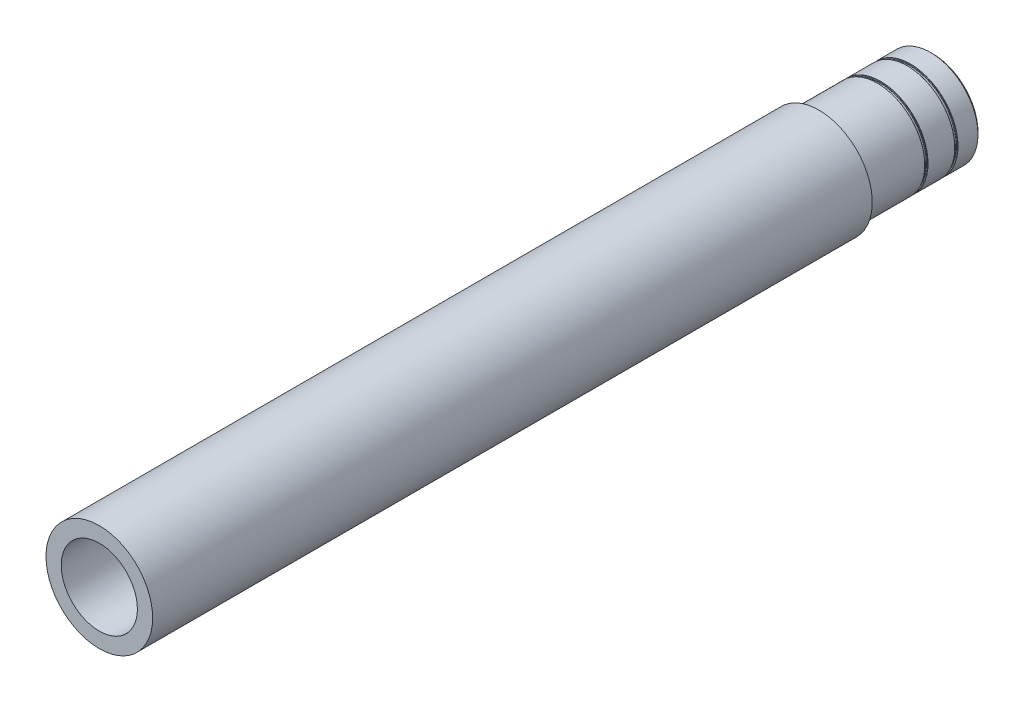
from build123d import *

# Parameters (mm, degrees)
SKETCH1_R           = 44.45
SKETCH1_R_2         = 31.75
BOSS_EXTRUDE1_DEPTH = 700
SKETCH2_OUTSIDE_W   = 233.14
SKETCH2_OUTSIDE_H   = 233.14
SKETCH2_OUTSIDE_R   = 39.6
CUT_EXTRUDE1_DEPTH  = 100
FILLET2_R           = 0.1778
SKETCH7_R           = 44.45
CUT_EXTRUDE3_DEPTH  = 5
CHAMFER1_SIZE       = 2


with BuildPart() as part:
    # Sketch1 → Boss-Extrude1 (new body)
    with BuildSketch(Plane.XY):
        Circle(SKETCH1_R)
        Circle(SKETCH1_R_2, mode=Mode.SUBTRACT)
    extrude(amount=BOSS_EXTRUDE1_DEPTH)

    # Sketch2 outside → Cut-Extrude1 (cut)
    with BuildSketch(Plane(origin=(0, 0, 0), x_dir=(-1, 0, 0), z_dir=(0, 0, -1))):
        Rectangle(SKETCH2_OUTSIDE_W, SKETCH2_OUTSIDE_H)
        Circle(SKETCH2_OUTSIDE_R, mode=Mode.SUBTRACT)
    extrude(amount=-CUT_EXTRUDE1_DEPTH, mode=Mode.SUBTRACT)

    # Sketch3 → Cut-Revolve1 (revolve, cut)
    with BuildSketch(Plane(origin=(0, 0, 0), x_dir=(0, 0, -1), z_dir=(1, 0, 0)), mode=Mode.PRIVATE) as cut_revolve1_sk:
        with BuildLine():
            Line((-51.1811, 40.8446), (-51.1811, 38.6094))
            ThreePointArc((-51.1811, 38.6094), (-51.106705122, 38.429794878), (-50.9271, 38.3554))
            Line((-50.9271, 38.3554), (-49.0729, 38.3554))
            ThreePointArc((-49.0729, 38.3554), (-48.893294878, 38.429794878), (-48.8189, 38.6094))
            Line((-48.8189, 38.6094), (-48.8189, 40.8446))
            Line((-48.8189, 40.8446), (-51.1811, 40.8446))
        make_face()
        with BuildLine():
            Line((-26.1811, 40.8446), (-26.1811, 38.6094))
            ThreePointArc((-26.1811, 38.6094), (-26.106705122, 38.429794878), (-25.9271, 38.3554))
            Line((-25.9271, 38.3554), (-24.0729, 38.3554))
            ThreePointArc((-24.0729, 38.3554), (-23.893294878, 38.429794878), (-23.8189, 38.6094))
            Line((-23.8189, 38.6094), (-23.8189, 40.8446))
            Line((-23.8189, 40.8446), (-26.1811, 40.8446))
        make_face()
    revolve(cut_revolve1_sk.sketch.rotate(Axis((0, 0, 700), (0, 0, -1)), 90), axis=Axis((0, 0, 700), (0, 0, -1)), mode=Mode.SUBTRACT)

    # Fillet2
    fillet2_edges = [part.edges().sort_by_distance(p)[0] for p in [
        (39.6, 0, 48.8189),
        (39.6, 0, 51.1811),
        (39.6, 0, 23.8189),
        (39.6, 0, 26.1811),
    ]]
    fillet(fillet2_edges, radius=FILLET2_R)

    # Sketch7 → Cut-Extrude3 (cut)
    with BuildSketch(Plane.XY):
        with Locations(Location((0, 0, 0), (0, 0, 180))):
            Circle(SKETCH7_R)
    extrude(amount=CUT_EXTRUDE3_DEPTH, mode=Mode.SUBTRACT)

    # Chamfer1
    chamfer1_edges = [part.edges().sort_by_distance(p)[0] for p in [
        (39.6, 0, 5),
    ]]
    chamfer(chamfer1_edges, length=CHAMFER1_SIZE)


solid = part.part
